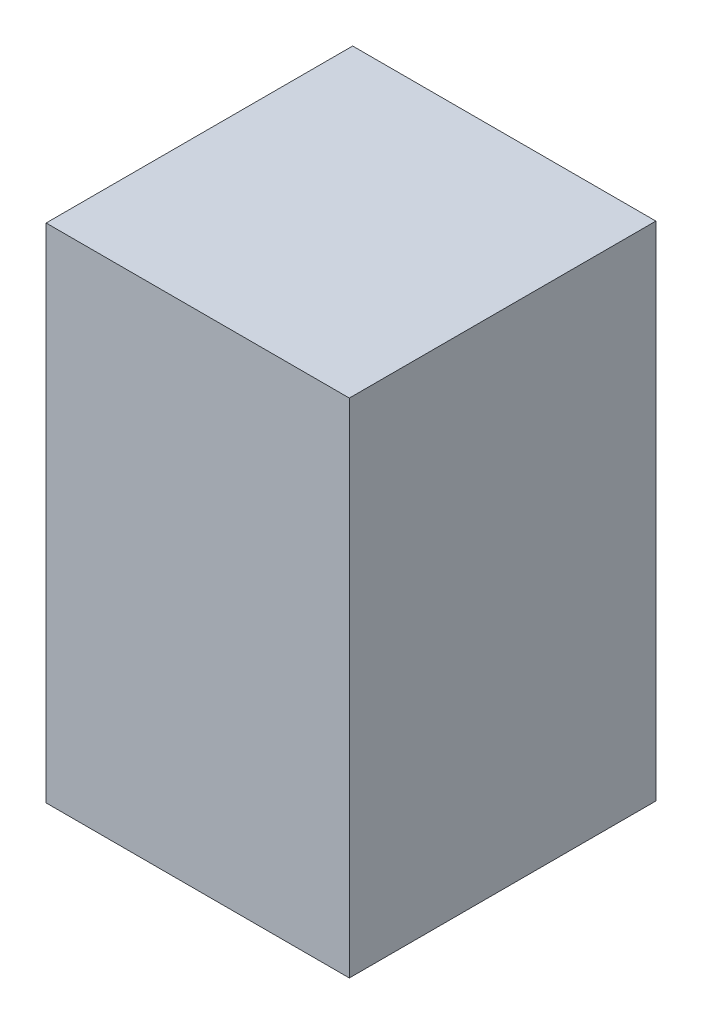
from build123d import *

# Parameters (mm, degrees)
SKIZZE1_W               = 30.187539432
SKIZZE1_H               = 30.518059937
LINEAR_AUSTRAGEN1_DEPTH = 50


with BuildPart() as part:
    # Skizze1 → Linear austragen1 (new body)
    with BuildSketch(Plane(origin=(0, 0, 0), x_dir=(1, 0, 0), z_dir=(0, 1, 0))):
        with Locations((15.093769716, 15.259029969)):
            Rectangle(SKIZZE1_W, SKIZZE1_H)
    extrude(amount=LINEAR_AUSTRAGEN1_DEPTH)


solid = part.part
